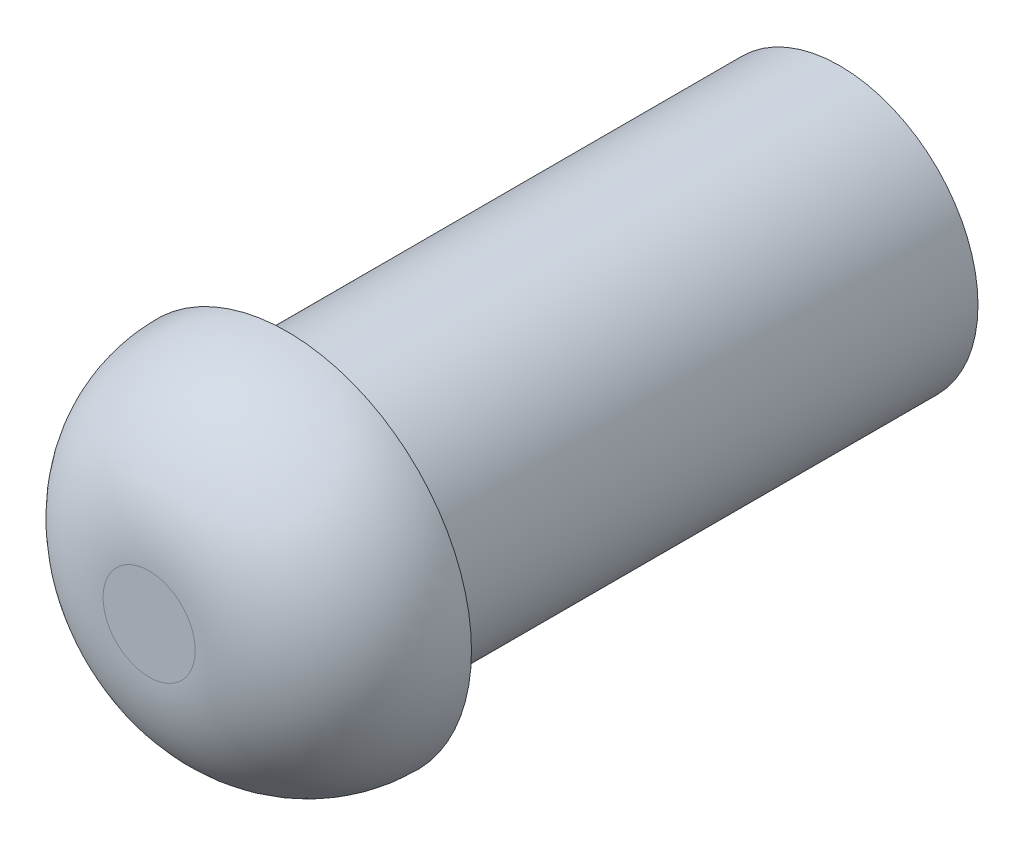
ISO-10303-21;
HEADER;
FILE_DESCRIPTION(('STEP AP214'),'2;1');
FILE_NAME('part.step','',(''),(''),'','','');
FILE_SCHEMA(('AUTOMOTIVE_DESIGN { 1 0 10303 214 1 1 1 1 }'));
ENDSEC;
DATA;
#1=APPLICATION_CONTEXT('core data for automotive mechanical design processes');
#2=APPLICATION_PROTOCOL_DEFINITION('international standard','automotive_design',2000,#1);
#3=PRODUCT_CONTEXT('',#1,'mechanical');
#4=PRODUCT('Part','Part','',(#3));
#5=PRODUCT_RELATED_PRODUCT_CATEGORY('part','',(#4));
#6=PRODUCT_DEFINITION_FORMATION('','',#4);
#7=PRODUCT_DEFINITION_CONTEXT('part definition',#1,'design');
#8=PRODUCT_DEFINITION('design','',#6,#7);
#9=PRODUCT_DEFINITION_SHAPE('','',#8);
#10=(LENGTH_UNIT() NAMED_UNIT(*) SI_UNIT(.MILLI.,.METRE.));
#11=(NAMED_UNIT(*) PLANE_ANGLE_UNIT() SI_UNIT($,.RADIAN.));
#12=(NAMED_UNIT(*) SI_UNIT($,.STERADIAN.) SOLID_ANGLE_UNIT());
#13=UNCERTAINTY_MEASURE_WITH_UNIT(LENGTH_MEASURE(1.E-05),#10,'distance_accuracy_value','');
#14=(GEOMETRIC_REPRESENTATION_CONTEXT(3) GLOBAL_UNCERTAINTY_ASSIGNED_CONTEXT((#13)) GLOBAL_UNIT_ASSIGNED_CONTEXT((#10,
#11,#12)) REPRESENTATION_CONTEXT('',''));
#15=CARTESIAN_POINT('',(0.,0.,0.));
#16=DIRECTION('',(0.,0.,1.));
#17=DIRECTION('',(1.,0.,0.));
#18=AXIS2_PLACEMENT_3D('',#15,#16,#17);
#19=CARTESIAN_POINT('',(0.,0.,0.));
#20=DIRECTION('',(0.,0.,1.));
#21=DIRECTION('',(1.,0.,0.));
#22=AXIS2_PLACEMENT_3D('',#19,#20,#21);
#23=PLANE('',#22);
#24=CARTESIAN_POINT('',(0.,0.,0.));
#25=DIRECTION('',(0.,0.,1.));
#26=DIRECTION('',(1.,0.,0.));
#27=AXIS2_PLACEMENT_3D('',#24,#25,#26);
#28=CIRCLE('',#27,4.);
#29=CARTESIAN_POINT('',(4.,0.,0.));
#30=VERTEX_POINT('',#29);
#31=EDGE_CURVE('E40',#30,#30,#28,.T.);
#32=ORIENTED_EDGE('',*,*,#31,.F.);
#33=EDGE_LOOP('',(#32));
#34=FACE_BOUND('',#33,.T.);
#35=CARTESIAN_POINT('',(0.,0.,0.));
#36=DIRECTION('',(0.,0.,1.));
#37=DIRECTION('',(1.,0.,0.));
#38=AXIS2_PLACEMENT_3D('',#35,#36,#37);
#39=CIRCLE('',#38,3.);
#40=CARTESIAN_POINT('',(3.,0.,0.));
#41=VERTEX_POINT('',#40);
#42=EDGE_CURVE('E36',#41,#41,#39,.F.);
#43=ORIENTED_EDGE('',*,*,#42,.F.);
#44=EDGE_LOOP('',(#43));
#45=FACE_BOUND('',#44,.T.);
#46=ADVANCED_FACE('F29',(#34,#45),#23,.F.);
#47=CARTESIAN_POINT('',(0.,0.,3.));
#48=DIRECTION('',(0.,0.,1.));
#49=DIRECTION('',(1.,0.,0.));
#50=AXIS2_PLACEMENT_3D('',#47,#48,#49);
#51=PLANE('',#50);
#52=CARTESIAN_POINT('',(0.,0.,3.));
#53=DIRECTION('',(0.,0.,1.));
#54=DIRECTION('',(1.,0.,0.));
#55=AXIS2_PLACEMENT_3D('',#52,#53,#54);
#56=CIRCLE('',#55,1.);
#57=CARTESIAN_POINT('',(1.,0.,3.));
#58=VERTEX_POINT('',#57);
#59=EDGE_CURVE('E10',#58,#58,#56,.T.);
#60=ORIENTED_EDGE('',*,*,#59,.T.);
#61=EDGE_LOOP('',(#60));
#62=FACE_BOUND('',#61,.T.);
#63=ADVANCED_FACE('F54',(#62),#51,.T.);
#64=CARTESIAN_POINT('',(0.,0.,-12.));
#65=DIRECTION('',(0.,0.,1.));
#66=DIRECTION('',(1.,0.,0.));
#67=AXIS2_PLACEMENT_3D('',#64,#65,#66);
#68=CYLINDRICAL_SURFACE('',#67,3.);
#69=CARTESIAN_POINT('',(0.,0.,-12.));
#70=DIRECTION('',(0.,0.,-1.));
#71=DIRECTION('',(-1.,0.,0.));
#72=AXIS2_PLACEMENT_3D('',#69,#70,#71);
#73=CIRCLE('',#72,3.);
#74=CARTESIAN_POINT('',(-3.,0.,-12.));
#75=VERTEX_POINT('',#74);
#76=EDGE_CURVE('E44',#75,#75,#73,.T.);
#77=ORIENTED_EDGE('',*,*,#76,.F.);
#78=EDGE_LOOP('',(#77));
#79=FACE_BOUND('',#78,.T.);
#80=ORIENTED_EDGE('',*,*,#42,.T.);
#81=EDGE_LOOP('',(#80));
#82=FACE_BOUND('',#81,.T.);
#83=ADVANCED_FACE('F52',(#79,#82),#68,.T.);
#84=CARTESIAN_POINT('',(0.,0.,-12.));
#85=DIRECTION('',(0.,0.,-1.));
#86=DIRECTION('',(-1.,0.,0.));
#87=AXIS2_PLACEMENT_3D('',#84,#85,#86);
#88=PLANE('',#87);
#89=ORIENTED_EDGE('',*,*,#76,.T.);
#90=EDGE_LOOP('',(#89));
#91=FACE_BOUND('',#90,.T.);
#92=ADVANCED_FACE('F50',(#91),#88,.T.);
#93=CARTESIAN_POINT('',(0.,0.,0.));
#94=DIRECTION('',(0.,0.,1.));
#95=DIRECTION('',(1.,0.,0.));
#96=AXIS2_PLACEMENT_3D('',#93,#94,#95);
#97=DEGENERATE_TOROIDAL_SURFACE('',#96,1.,3.,.T.);
#98=ORIENTED_EDGE('',*,*,#31,.T.);
#99=EDGE_LOOP('',(#98));
#100=FACE_BOUND('',#99,.T.);
#101=ORIENTED_EDGE('',*,*,#59,.F.);
#102=EDGE_LOOP('',(#101));
#103=FACE_BOUND('',#102,.T.);
#104=ADVANCED_FACE('F31',(#100,#103),#97,.T.);
#105=CLOSED_SHELL('',(#46,#63,#83,#92,#104));
#106=MANIFOLD_SOLID_BREP('B2',#105);
#107=ADVANCED_BREP_SHAPE_REPRESENTATION('',(#18,#106),#14);
#108=SHAPE_DEFINITION_REPRESENTATION(#9,#107);
ENDSEC;
END-ISO-10303-21;
